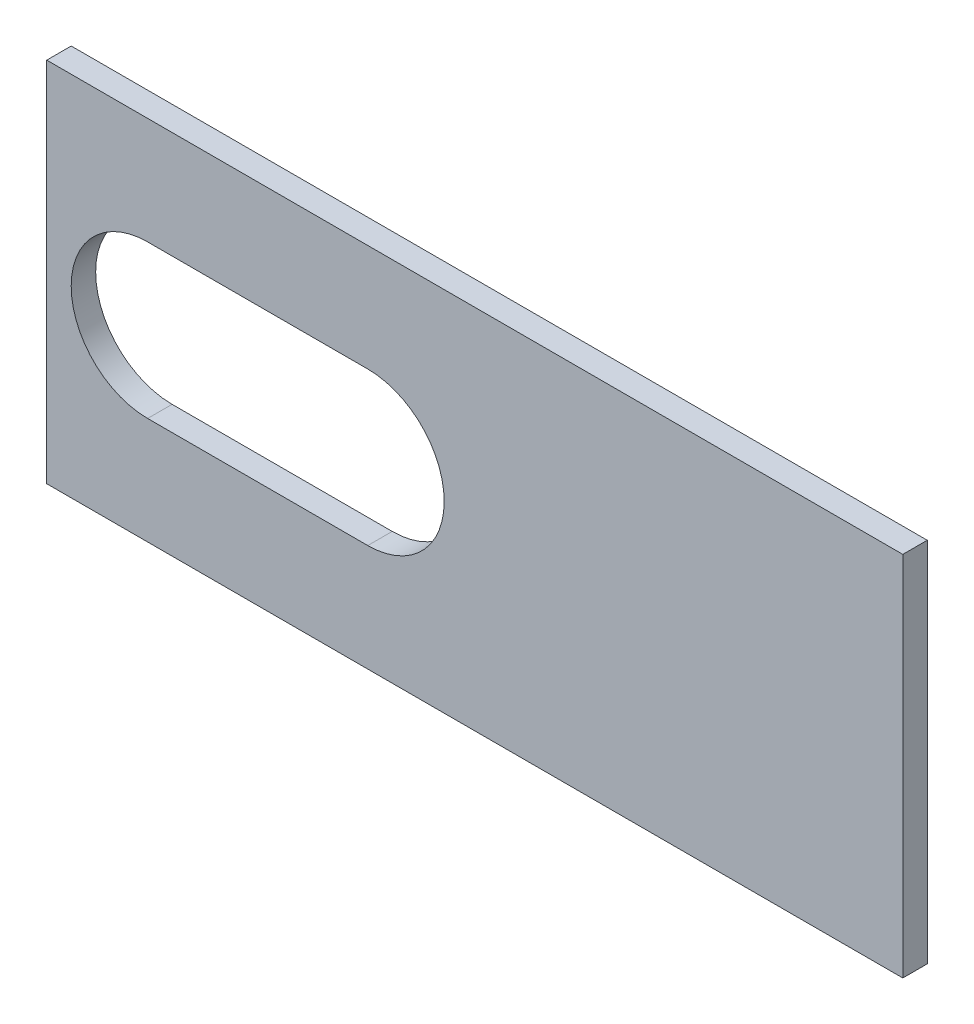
from build123d import *

# Parameters (mm, degrees)
SKIZZE1_W                       = 700
SKIZZE1_H                       = 300
AUFSATZ_LINEAR_AUSTRAGEN1_DEPTH = 20
SCHNITT_LINEAR_AUSTRAGEN1_DEPTH = 382.313519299


with BuildPart() as part:
    # Skizze1 → Aufsatz-Linear austragen1 (new body)
    with BuildSketch(Plane.XY):
        Rectangle(SKIZZE1_W, SKIZZE1_H)
    extrude(amount=AUFSATZ_LINEAR_AUSTRAGEN1_DEPTH)

    # Skizze3 → Schnitt-Linear austragen1 (cut, through all)
    with BuildSketch(Plane.XY.offset(20)):
        with BuildLine():
            Line((-267.5, 62.5), (-87.5, 62.5))
            ThreePointArc((-87.5, 62.5), (-25, 0), (-87.5, -62.5))
            Line((-87.5, -62.5), (-267.5, -62.5))
            ThreePointArc((-267.5, -62.5), (-330, 0), (-267.5, 62.5))
        make_face()
    extrude(amount=-SCHNITT_LINEAR_AUSTRAGEN1_DEPTH, mode=Mode.SUBTRACT)


solid = part.part
